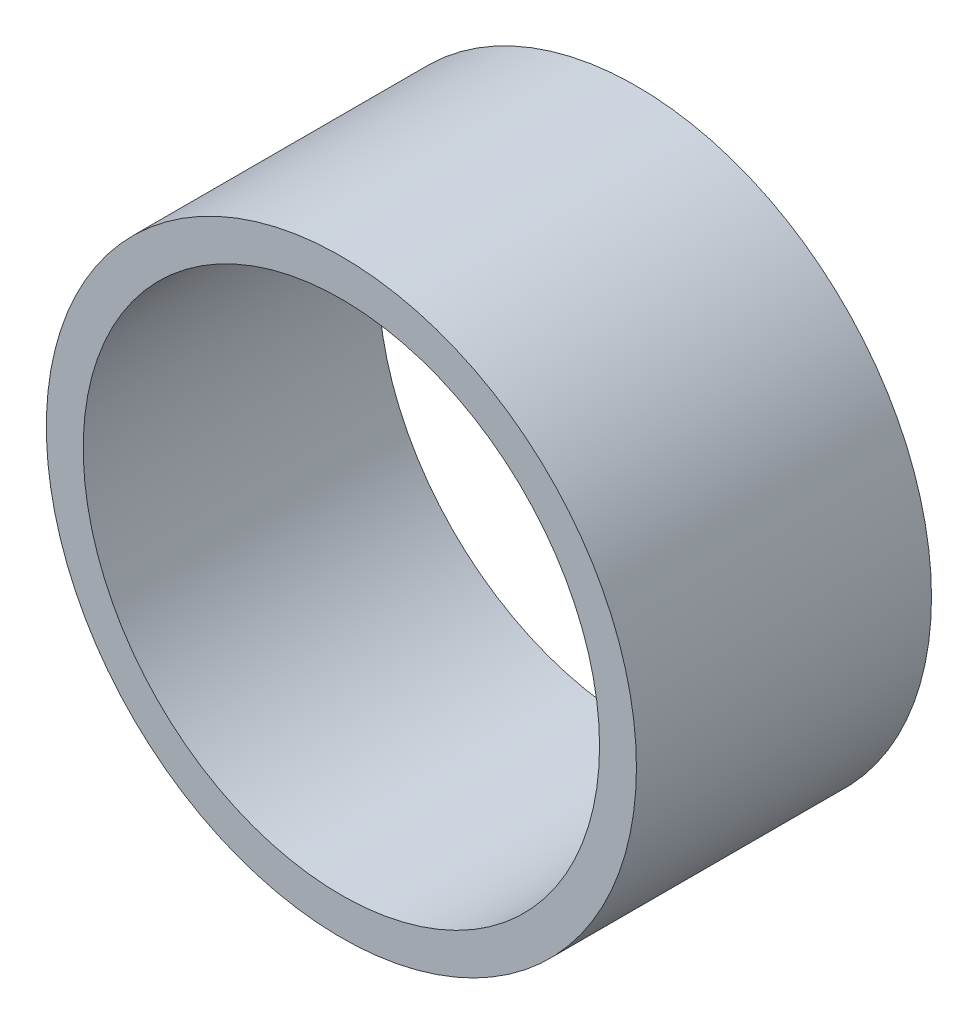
from build123d import *

# Parameters (mm, degrees)
SKETCH1_R      = 50.8
SKETCH1_R_2    = 44.45
EXTRUDE1_DEPTH = 25.4


with BuildPart() as part:
    # Sketch1 → Extrude1 (new, symmetric)
    with BuildSketch(Plane.XY):
        Circle(SKETCH1_R)
        Circle(SKETCH1_R_2, mode=Mode.SUBTRACT)
    extrude(amount=EXTRUDE1_DEPTH, both=True)


solid = part.part
